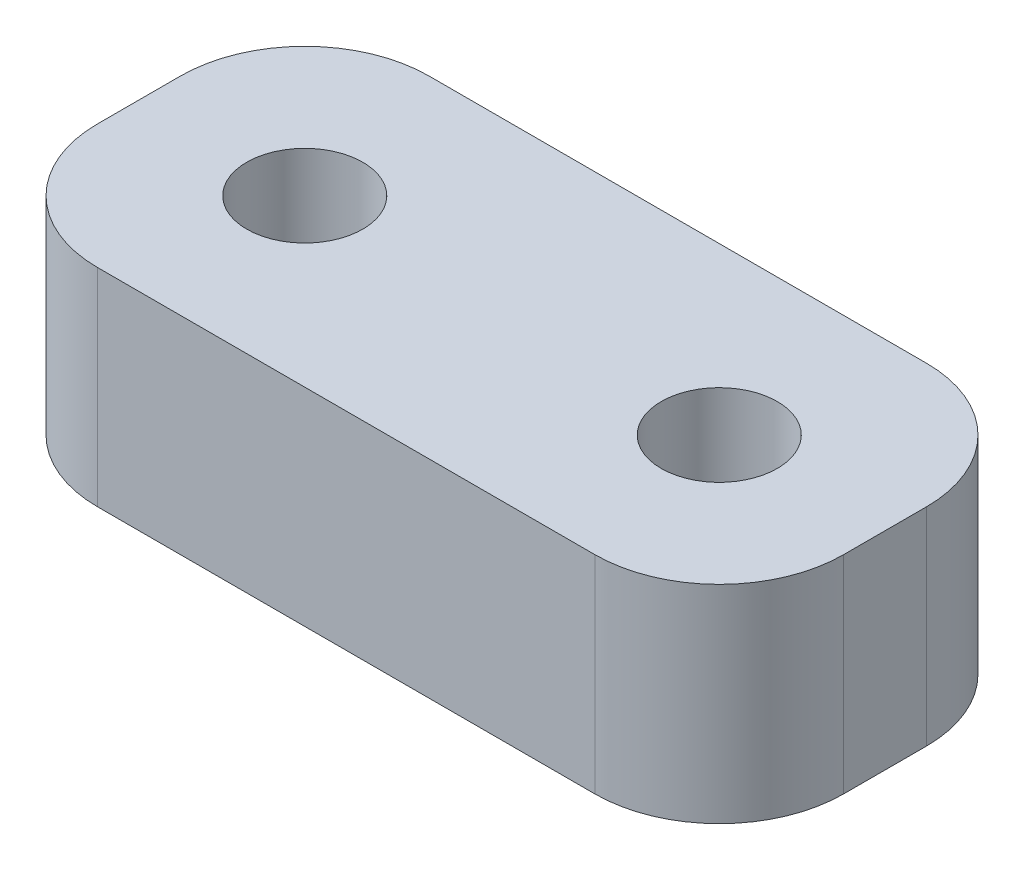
from build123d import *

# Parameters (mm, degrees)
SKETCH1_W           = 18
SKETCH1_H           = 8
SKETCH1_R           = 1.4
BOSS_EXTRUDE1_DEPTH = 5
FILLET1_R           = 3


with BuildPart() as part:
    # Sketch1 → Boss-Extrude1 (new body)
    with BuildSketch(Plane(origin=(0, 0, 0), x_dir=(1, 0, 0), z_dir=(0, 1, 0))):
        with Locations((0, -1.752347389)):
            Rectangle(SKETCH1_W, SKETCH1_H)
        with Locations(Location((-5, -1.752347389, 0), (0, 0, 270))):
            Circle(SKETCH1_R, mode=Mode.SUBTRACT)
        with Locations(Location((5, -1.752347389, 0), (0, 0, 270))):
            Circle(SKETCH1_R, mode=Mode.SUBTRACT)
    extrude(amount=BOSS_EXTRUDE1_DEPTH)

    # Fillet1
    fillet1_edges = [part.edges().sort_by_distance(p)[0] for p in [
        (-9, 2.5, -2.247652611),
        (9, 2.5, -2.247652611),
        (9, 2.5, 5.752347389),
        (-9, 2.5, 5.752347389),
    ]]
    fillet(fillet1_edges, radius=FILLET1_R)


solid = part.part
